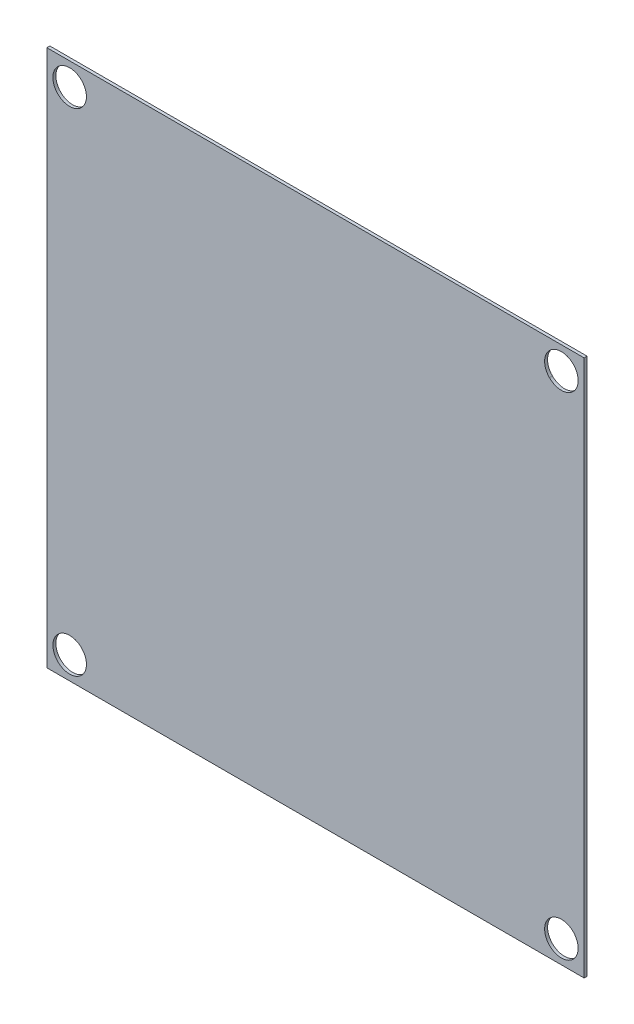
ISO-10303-21;
HEADER;
FILE_DESCRIPTION(('STEP AP214'),'2;1');
FILE_NAME('part.step','',(''),(''),'','','');
FILE_SCHEMA(('AUTOMOTIVE_DESIGN { 1 0 10303 214 1 1 1 1 }'));
ENDSEC;
DATA;
#1=APPLICATION_CONTEXT('core data for automotive mechanical design processes');
#2=APPLICATION_PROTOCOL_DEFINITION('international standard','automotive_design',2000,#1);
#3=PRODUCT_CONTEXT('',#1,'mechanical');
#4=PRODUCT('Part','Part','',(#3));
#5=PRODUCT_RELATED_PRODUCT_CATEGORY('part','',(#4));
#6=PRODUCT_DEFINITION_FORMATION('','',#4);
#7=PRODUCT_DEFINITION_CONTEXT('part definition',#1,'design');
#8=PRODUCT_DEFINITION('design','',#6,#7);
#9=PRODUCT_DEFINITION_SHAPE('','',#8);
#10=(LENGTH_UNIT() NAMED_UNIT(*) SI_UNIT(.MILLI.,.METRE.));
#11=(NAMED_UNIT(*) PLANE_ANGLE_UNIT() SI_UNIT($,.RADIAN.));
#12=(NAMED_UNIT(*) SI_UNIT($,.STERADIAN.) SOLID_ANGLE_UNIT());
#13=UNCERTAINTY_MEASURE_WITH_UNIT(LENGTH_MEASURE(1.E-05),#10,'distance_accuracy_value','');
#14=(GEOMETRIC_REPRESENTATION_CONTEXT(3) GLOBAL_UNCERTAINTY_ASSIGNED_CONTEXT((#13)) GLOBAL_UNIT_ASSIGNED_CONTEXT((#10,
#11,#12)) REPRESENTATION_CONTEXT('',''));
#15=CARTESIAN_POINT('',(0.,0.,0.));
#16=DIRECTION('',(0.,0.,1.));
#17=DIRECTION('',(1.,0.,0.));
#18=AXIS2_PLACEMENT_3D('',#15,#16,#17);
#19=CARTESIAN_POINT('',(0.,0.,1.5748));
#20=DIRECTION('',(0.,0.,1.));
#21=DIRECTION('',(1.,0.,0.));
#22=AXIS2_PLACEMENT_3D('',#19,#20,#21);
#23=PLANE('',#22);
#24=CARTESIAN_POINT('',(35.1975713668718,306.352825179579,1.5748));
#25=DIRECTION('',(0.,0.,1.));
#26=DIRECTION('',(1.,0.,0.));
#27=AXIS2_PLACEMENT_3D('',#24,#25,#26);
#28=CIRCLE('',#27,8.89000000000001);
#29=CARTESIAN_POINT('',(44.0875713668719,306.352825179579,1.5748));
#30=VERTEX_POINT('',#29);
#31=EDGE_CURVE('E224',#30,#30,#28,.F.);
#32=ORIENTED_EDGE('',*,*,#31,.T.);
#33=EDGE_LOOP('',(#32));
#34=FACE_BOUND('',#33,.T.);
#35=CARTESIAN_POINT('',(295.923411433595,45.6939107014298,1.5748));
#36=DIRECTION('',(0.,0.,1.));
#37=DIRECTION('',(1.,0.,0.));
#38=AXIS2_PLACEMENT_3D('',#35,#36,#37);
#39=CIRCLE('',#38,8.89000000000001);
#40=CARTESIAN_POINT('',(304.813411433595,45.6939107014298,1.5748));
#41=VERTEX_POINT('',#40);
#42=EDGE_CURVE('E237',#41,#41,#39,.F.);
#43=ORIENTED_EDGE('',*,*,#42,.T.);
#44=EDGE_LOOP('',(#43));
#45=FACE_BOUND('',#44,.T.);
#46=CARTESIAN_POINT('',(296.409533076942,306.825673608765,1.5748));
#47=DIRECTION('',(0.,0.,-1.));
#48=DIRECTION('',(-1.,0.,0.));
#49=AXIS2_PLACEMENT_3D('',#46,#47,#48);
#50=CIRCLE('',#49,9.56815919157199);
#51=CARTESIAN_POINT('',(289.636383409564,300.067410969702,1.5748));
#52=VERTEX_POINT('',#51);
#53=CARTESIAN_POINT('',(289.550834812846,300.154247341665,1.5748));
#54=VERTEX_POINT('',#53);
#55=EDGE_CURVE('E124',#52,#54,#50,.T.);
#56=ORIENTED_EDGE('',*,*,#55,.T.);
#57=CARTESIAN_POINT('',(295.923411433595,306.352825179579,1.5748));
#58=DIRECTION('',(0.,0.,1.));
#59=DIRECTION('',(1.,0.,0.));
#60=AXIS2_PLACEMENT_3D('',#57,#58,#59);
#61=CIRCLE('',#60,8.89000000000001);
#62=CARTESIAN_POINT('',(289.636425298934,300.067452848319,1.5748));
#63=VERTEX_POINT('',#62);
#64=EDGE_CURVE('E113',#63,#54,#61,.T.);
#65=ORIENTED_EDGE('',*,*,#64,.F.);
#66=DIRECTION('',(-0.707197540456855,-0.707016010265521,0.));
#67=VECTOR('',#66,1.);
#68=CARTESIAN_POINT('',(-5.25268691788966,5.25403557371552,1.5748));
#69=LINE('',#68,#67);
#70=EDGE_CURVE('E119',#63,#52,#69,.T.);
#71=ORIENTED_EDGE('',*,*,#70,.T.);
#72=EDGE_LOOP('',(#56,#65,#71));
#73=FACE_BOUND('',#72,.T.);
#74=DIRECTION('',(1.,0.,0.));
#75=VECTOR('',#74,1.);
#76=CARTESIAN_POINT('',(23.1439345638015,318.403367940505,1.5748));
#77=LINE('',#76,#75);
#78=CARTESIAN_POINT('',(23.1439345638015,318.403367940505,1.5748));
#79=VERTEX_POINT('',#78);
#80=CARTESIAN_POINT('',(307.977048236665,318.403367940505,1.5748));
#81=VERTEX_POINT('',#80);
#82=EDGE_CURVE('E139',#79,#81,#77,.T.);
#83=ORIENTED_EDGE('',*,*,#82,.F.);
#84=DIRECTION('',(0.,1.,0.));
#85=VECTOR('',#84,1.);
#86=CARTESIAN_POINT('',(23.1439345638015,33.6433679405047,1.5748));
#87=LINE('',#86,#85);
#88=CARTESIAN_POINT('',(23.1439345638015,33.6433679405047,1.5748));
#89=VERTEX_POINT('',#88);
#90=EDGE_CURVE('E147',#89,#79,#87,.T.);
#91=ORIENTED_EDGE('',*,*,#90,.F.);
#92=DIRECTION('',(1.,0.,0.));
#93=VECTOR('',#92,1.);
#94=CARTESIAN_POINT('',(23.1439345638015,33.6433679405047,1.5748));
#95=LINE('',#94,#93);
#96=CARTESIAN_POINT('',(307.977048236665,33.6433679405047,1.5748));
#97=VERTEX_POINT('',#96);
#98=EDGE_CURVE('E145',#89,#97,#95,.T.);
#99=ORIENTED_EDGE('',*,*,#98,.T.);
#100=DIRECTION('',(0.,1.,0.));
#101=VECTOR('',#100,1.);
#102=CARTESIAN_POINT('',(307.977048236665,33.6433679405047,1.5748));
#103=LINE('',#102,#101);
#104=EDGE_CURVE('E142',#97,#81,#103,.T.);
#105=ORIENTED_EDGE('',*,*,#104,.T.);
#106=EDGE_LOOP('',(#83,#91,#99,#105));
#107=FACE_BOUND('',#106,.T.);
#108=CARTESIAN_POINT('',(35.1975713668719,45.6939107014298,1.5748));
#109=DIRECTION('',(0.,0.,1.));
#110=DIRECTION('',(1.,0.,0.));
#111=AXIS2_PLACEMENT_3D('',#108,#109,#110);
#112=CIRCLE('',#111,8.89000000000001);
#113=CARTESIAN_POINT('',(44.0875713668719,45.6939107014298,1.5748));
#114=VERTEX_POINT('',#113);
#115=EDGE_CURVE('E229',#114,#114,#112,.T.);
#116=ORIENTED_EDGE('',*,*,#115,.F.);
#117=EDGE_LOOP('',(#116));
#118=FACE_BOUND('',#117,.T.);
#119=ADVANCED_FACE('F50',(#34,#45,#73,#107,#118),#23,.T.);
#120=CARTESIAN_POINT('',(0.,0.,0.));
#121=DIRECTION('',(0.,0.,1.));
#122=DIRECTION('',(1.,0.,0.));
#123=AXIS2_PLACEMENT_3D('',#120,#121,#122);
#124=PLANE('',#123);
#125=CARTESIAN_POINT('',(35.1975713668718,306.352825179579,0.));
#126=DIRECTION('',(0.,0.,1.));
#127=DIRECTION('',(1.,0.,0.));
#128=AXIS2_PLACEMENT_3D('',#125,#126,#127);
#129=CIRCLE('',#128,8.89000000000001);
#130=CARTESIAN_POINT('',(44.0875713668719,306.352825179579,0.));
#131=VERTEX_POINT('',#130);
#132=EDGE_CURVE('E125',#131,#131,#129,.F.);
#133=ORIENTED_EDGE('',*,*,#132,.F.);
#134=EDGE_LOOP('',(#133));
#135=FACE_BOUND('',#134,.T.);
#136=DIRECTION('',(1.,0.,0.));
#137=VECTOR('',#136,1.);
#138=CARTESIAN_POINT('',(23.1439345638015,318.403367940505,0.));
#139=LINE('',#138,#137);
#140=CARTESIAN_POINT('',(23.1439345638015,318.403367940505,0.));
#141=VERTEX_POINT('',#140);
#142=CARTESIAN_POINT('',(307.977048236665,318.403367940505,0.));
#143=VERTEX_POINT('',#142);
#144=EDGE_CURVE('E137',#141,#143,#139,.T.);
#145=ORIENTED_EDGE('',*,*,#144,.T.);
#146=DIRECTION('',(0.,1.,0.));
#147=VECTOR('',#146,1.);
#148=CARTESIAN_POINT('',(307.977048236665,33.6433679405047,0.));
#149=LINE('',#148,#147);
#150=CARTESIAN_POINT('',(307.977048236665,33.6433679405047,0.));
#151=VERTEX_POINT('',#150);
#152=EDGE_CURVE('E152',#151,#143,#149,.T.);
#153=ORIENTED_EDGE('',*,*,#152,.F.);
#154=DIRECTION('',(1.,0.,0.));
#155=VECTOR('',#154,1.);
#156=CARTESIAN_POINT('',(23.1439345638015,33.6433679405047,0.));
#157=LINE('',#156,#155);
#158=CARTESIAN_POINT('',(23.1439345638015,33.6433679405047,0.));
#159=VERTEX_POINT('',#158);
#160=EDGE_CURVE('E155',#159,#151,#157,.T.);
#161=ORIENTED_EDGE('',*,*,#160,.F.);
#162=DIRECTION('',(0.,1.,0.));
#163=VECTOR('',#162,1.);
#164=CARTESIAN_POINT('',(23.1439345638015,33.6433679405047,0.));
#165=LINE('',#164,#163);
#166=EDGE_CURVE('E143',#159,#141,#165,.T.);
#167=ORIENTED_EDGE('',*,*,#166,.T.);
#168=EDGE_LOOP('',(#145,#153,#161,#167));
#169=FACE_BOUND('',#168,.T.);
#170=CARTESIAN_POINT('',(296.409533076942,306.825673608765,0.));
#171=DIRECTION('',(0.,0.,-1.));
#172=DIRECTION('',(-1.,0.,0.));
#173=AXIS2_PLACEMENT_3D('',#170,#171,#172);
#174=CIRCLE('',#173,9.56815919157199);
#175=CARTESIAN_POINT('',(289.636383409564,300.067410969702,0.));
#176=VERTEX_POINT('',#175);
#177=CARTESIAN_POINT('',(289.550834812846,300.154247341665,0.));
#178=VERTEX_POINT('',#177);
#179=EDGE_CURVE('E67',#176,#178,#174,.T.);
#180=ORIENTED_EDGE('',*,*,#179,.F.);
#181=DIRECTION('',(0.707197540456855,0.707016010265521,0.));
#182=VECTOR('',#181,1.);
#183=CARTESIAN_POINT('',(-5.25268691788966,5.25403557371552,0.));
#184=LINE('',#183,#182);
#185=CARTESIAN_POINT('',(289.636425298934,300.067452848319,0.));
#186=VERTEX_POINT('',#185);
#187=EDGE_CURVE('E134',#176,#186,#184,.T.);
#188=ORIENTED_EDGE('',*,*,#187,.T.);
#189=CARTESIAN_POINT('',(295.923411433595,306.352825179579,0.));
#190=DIRECTION('',(0.,0.,1.));
#191=DIRECTION('',(1.,0.,0.));
#192=AXIS2_PLACEMENT_3D('',#189,#190,#191);
#193=CIRCLE('',#192,8.89000000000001);
#194=EDGE_CURVE('E114',#178,#186,#193,.F.);
#195=ORIENTED_EDGE('',*,*,#194,.F.);
#196=EDGE_LOOP('',(#180,#188,#195));
#197=FACE_BOUND('',#196,.T.);
#198=CARTESIAN_POINT('',(295.923411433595,45.6939107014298,0.));
#199=DIRECTION('',(0.,0.,1.));
#200=DIRECTION('',(1.,0.,0.));
#201=AXIS2_PLACEMENT_3D('',#198,#199,#200);
#202=CIRCLE('',#201,8.89000000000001);
#203=CARTESIAN_POINT('',(304.813411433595,45.6939107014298,0.));
#204=VERTEX_POINT('',#203);
#205=EDGE_CURVE('E234',#204,#204,#202,.F.);
#206=ORIENTED_EDGE('',*,*,#205,.F.);
#207=EDGE_LOOP('',(#206));
#208=FACE_BOUND('',#207,.T.);
#209=CARTESIAN_POINT('',(35.1975713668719,45.6939107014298,0.));
#210=DIRECTION('',(0.,0.,1.));
#211=DIRECTION('',(1.,0.,0.));
#212=AXIS2_PLACEMENT_3D('',#209,#210,#211);
#213=CIRCLE('',#212,8.89000000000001);
#214=CARTESIAN_POINT('',(44.0875713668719,45.6939107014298,0.));
#215=VERTEX_POINT('',#214);
#216=EDGE_CURVE('E225',#215,#215,#213,.T.);
#217=ORIENTED_EDGE('',*,*,#216,.T.);
#218=EDGE_LOOP('',(#217));
#219=FACE_BOUND('',#218,.T.);
#220=ADVANCED_FACE('F172',(#135,#169,#197,#208,#219),#124,.F.);
#221=CARTESIAN_POINT('',(23.1439345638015,318.403367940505,1.5748));
#222=DIRECTION('',(0.,1.,0.));
#223=DIRECTION('',(-1.,0.,0.));
#224=AXIS2_PLACEMENT_3D('',#221,#222,#223);
#225=PLANE('',#224);
#226=ORIENTED_EDGE('',*,*,#144,.F.);
#227=DIRECTION('',(0.,0.,-1.));
#228=VECTOR('',#227,1.);
#229=CARTESIAN_POINT('',(23.1439345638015,318.403367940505,1.5748));
#230=LINE('',#229,#228);
#231=EDGE_CURVE('E12',#79,#141,#230,.T.);
#232=ORIENTED_EDGE('',*,*,#231,.F.);
#233=ORIENTED_EDGE('',*,*,#82,.T.);
#234=DIRECTION('',(0.,0.,-1.));
#235=VECTOR('',#234,1.);
#236=CARTESIAN_POINT('',(307.977048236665,318.403367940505,1.5748));
#237=LINE('',#236,#235);
#238=EDGE_CURVE('E54',#81,#143,#237,.T.);
#239=ORIENTED_EDGE('',*,*,#238,.T.);
#240=EDGE_LOOP('',(#226,#232,#233,#239));
#241=FACE_BOUND('',#240,.T.);
#242=ADVANCED_FACE('F52',(#241),#225,.T.);
#243=CARTESIAN_POINT('',(23.1439345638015,33.6433679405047,1.5748));
#244=DIRECTION('',(-1.,0.,0.));
#245=DIRECTION('',(0.,0.,1.));
#246=AXIS2_PLACEMENT_3D('',#243,#244,#245);
#247=PLANE('',#246);
#248=ORIENTED_EDGE('',*,*,#166,.F.);
#249=DIRECTION('',(0.,0.,-1.));
#250=VECTOR('',#249,1.);
#251=CARTESIAN_POINT('',(23.1439345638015,33.6433679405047,1.5748));
#252=LINE('',#251,#250);
#253=EDGE_CURVE('E59',#89,#159,#252,.T.);
#254=ORIENTED_EDGE('',*,*,#253,.F.);
#255=ORIENTED_EDGE('',*,*,#90,.T.);
#256=ORIENTED_EDGE('',*,*,#231,.T.);
#257=EDGE_LOOP('',(#248,#254,#255,#256));
#258=FACE_BOUND('',#257,.T.);
#259=ADVANCED_FACE('F176',(#258),#247,.T.);
#260=CARTESIAN_POINT('',(23.1439345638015,33.6433679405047,1.5748));
#261=DIRECTION('',(0.,1.,0.));
#262=DIRECTION('',(0.,0.,1.));
#263=AXIS2_PLACEMENT_3D('',#260,#261,#262);
#264=PLANE('',#263);
#265=ORIENTED_EDGE('',*,*,#160,.T.);
#266=DIRECTION('',(0.,0.,-1.));
#267=VECTOR('',#266,1.);
#268=CARTESIAN_POINT('',(307.977048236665,33.6433679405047,1.5748));
#269=LINE('',#268,#267);
#270=EDGE_CURVE('E159',#97,#151,#269,.T.);
#271=ORIENTED_EDGE('',*,*,#270,.F.);
#272=ORIENTED_EDGE('',*,*,#98,.F.);
#273=ORIENTED_EDGE('',*,*,#253,.T.);
#274=EDGE_LOOP('',(#265,#271,#272,#273));
#275=FACE_BOUND('',#274,.T.);
#276=ADVANCED_FACE('F181',(#275),#264,.F.);
#277=CARTESIAN_POINT('',(307.977048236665,33.6433679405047,1.5748));
#278=DIRECTION('',(-1.,0.,0.));
#279=DIRECTION('',(0.,0.,1.));
#280=AXIS2_PLACEMENT_3D('',#277,#278,#279);
#281=PLANE('',#280);
#282=ORIENTED_EDGE('',*,*,#152,.T.);
#283=ORIENTED_EDGE('',*,*,#238,.F.);
#284=ORIENTED_EDGE('',*,*,#104,.F.);
#285=ORIENTED_EDGE('',*,*,#270,.T.);
#286=EDGE_LOOP('',(#282,#283,#284,#285));
#287=FACE_BOUND('',#286,.T.);
#288=ADVANCED_FACE('F169',(#287),#281,.F.);
#289=CARTESIAN_POINT('',(296.409533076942,306.825673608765,1.5748));
#290=DIRECTION('',(0.,0.,-1.));
#291=DIRECTION('',(-1.,0.,0.));
#292=AXIS2_PLACEMENT_3D('',#289,#290,#291);
#293=CYLINDRICAL_SURFACE('',#292,9.56815919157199);
#294=ORIENTED_EDGE('',*,*,#179,.T.);
#295=DIRECTION('',(0.,0.,1.));
#296=VECTOR('',#295,1.);
#297=CARTESIAN_POINT('',(289.550834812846,300.154247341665,-27.0628409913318));
#298=LINE('',#297,#296);
#299=EDGE_CURVE('E72',#178,#54,#298,.T.);
#300=ORIENTED_EDGE('',*,*,#299,.T.);
#301=ORIENTED_EDGE('',*,*,#55,.F.);
#302=DIRECTION('',(0.,0.,1.));
#303=VECTOR('',#302,1.);
#304=CARTESIAN_POINT('',(289.636383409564,300.067410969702,-27.0628409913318));
#305=LINE('',#304,#303);
#306=EDGE_CURVE('E118',#176,#52,#305,.T.);
#307=ORIENTED_EDGE('',*,*,#306,.F.);
#308=EDGE_LOOP('',(#294,#300,#301,#307));
#309=FACE_BOUND('',#308,.T.);
#310=ADVANCED_FACE('F188',(#309),#293,.F.);
#311=CARTESIAN_POINT('',(295.923411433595,306.352825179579,-27.0628409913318));
#312=DIRECTION('',(0.,0.,1.));
#313=DIRECTION('',(1.,0.,0.));
#314=AXIS2_PLACEMENT_3D('',#311,#312,#313);
#315=CYLINDRICAL_SURFACE('',#314,8.89000000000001);
#316=ORIENTED_EDGE('',*,*,#299,.F.);
#317=ORIENTED_EDGE('',*,*,#194,.T.);
#318=DIRECTION('',(0.,0.,1.));
#319=VECTOR('',#318,1.);
#320=CARTESIAN_POINT('',(289.636425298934,300.067452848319,-27.0628409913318));
#321=LINE('',#320,#319);
#322=EDGE_CURVE('E110',#186,#63,#321,.T.);
#323=ORIENTED_EDGE('',*,*,#322,.T.);
#324=ORIENTED_EDGE('',*,*,#64,.T.);
#325=EDGE_LOOP('',(#316,#317,#323,#324));
#326=FACE_BOUND('',#325,.T.);
#327=ADVANCED_FACE('F112',(#326),#315,.F.);
#328=CARTESIAN_POINT('',(-5.25268691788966,5.25403557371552,-27.0628409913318));
#329=DIRECTION('',(-0.707016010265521,0.707197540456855,0.));
#330=DIRECTION('',(-0.707197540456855,-0.707016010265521,0.));
#331=AXIS2_PLACEMENT_3D('',#328,#329,#330);
#332=PLANE('',#331);
#333=ORIENTED_EDGE('',*,*,#187,.F.);
#334=ORIENTED_EDGE('',*,*,#306,.T.);
#335=ORIENTED_EDGE('',*,*,#70,.F.);
#336=ORIENTED_EDGE('',*,*,#322,.F.);
#337=EDGE_LOOP('',(#333,#334,#335,#336));
#338=FACE_BOUND('',#337,.T.);
#339=ADVANCED_FACE('F128',(#338),#332,.T.);
#340=CARTESIAN_POINT('',(295.923411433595,45.6939107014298,0.));
#341=DIRECTION('',(0.,0.,1.));
#342=DIRECTION('',(1.,0.,0.));
#343=AXIS2_PLACEMENT_3D('',#340,#341,#342);
#344=CYLINDRICAL_SURFACE('',#343,8.89000000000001);
#345=ORIENTED_EDGE('',*,*,#205,.T.);
#346=EDGE_LOOP('',(#345));
#347=FACE_BOUND('',#346,.T.);
#348=ORIENTED_EDGE('',*,*,#42,.F.);
#349=EDGE_LOOP('',(#348));
#350=FACE_BOUND('',#349,.T.);
#351=ADVANCED_FACE('F207',(#347,#350),#344,.F.);
#352=CARTESIAN_POINT('',(35.1975713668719,45.6939107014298,0.));
#353=DIRECTION('',(0.,0.,1.));
#354=DIRECTION('',(1.,0.,0.));
#355=AXIS2_PLACEMENT_3D('',#352,#353,#354);
#356=CYLINDRICAL_SURFACE('',#355,8.89000000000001);
#357=ORIENTED_EDGE('',*,*,#216,.F.);
#358=EDGE_LOOP('',(#357));
#359=FACE_BOUND('',#358,.T.);
#360=ORIENTED_EDGE('',*,*,#115,.T.);
#361=EDGE_LOOP('',(#360));
#362=FACE_BOUND('',#361,.T.);
#363=ADVANCED_FACE('F210',(#359,#362),#356,.F.);
#364=CARTESIAN_POINT('',(35.1975713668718,306.352825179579,0.));
#365=DIRECTION('',(0.,0.,1.));
#366=DIRECTION('',(1.,0.,0.));
#367=AXIS2_PLACEMENT_3D('',#364,#365,#366);
#368=CYLINDRICAL_SURFACE('',#367,8.89000000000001);
#369=ORIENTED_EDGE('',*,*,#132,.T.);
#370=EDGE_LOOP('',(#369));
#371=FACE_BOUND('',#370,.T.);
#372=ORIENTED_EDGE('',*,*,#31,.F.);
#373=EDGE_LOOP('',(#372));
#374=FACE_BOUND('',#373,.T.);
#375=ADVANCED_FACE('F214',(#371,#374),#368,.F.);
#376=CLOSED_SHELL('',(#119,#220,#242,#259,#276,#288,#310,#327,#339,#351,#363,#375));
#377=MANIFOLD_SOLID_BREP('B2',#376);
#378=ADVANCED_BREP_SHAPE_REPRESENTATION('',(#18,#377),#14);
#379=SHAPE_DEFINITION_REPRESENTATION(#9,#378);
ENDSEC;
END-ISO-10303-21;
